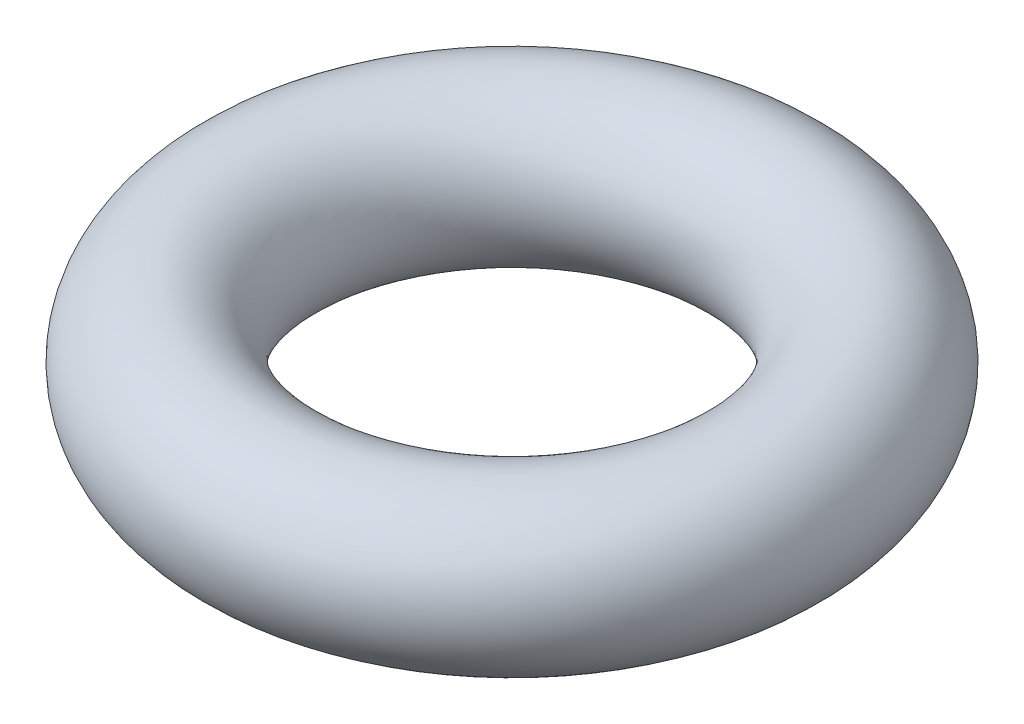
ISO-10303-21;
HEADER;
FILE_DESCRIPTION(('STEP AP214'),'2;1');
FILE_NAME('part.step','',(''),(''),'','','');
FILE_SCHEMA(('AUTOMOTIVE_DESIGN { 1 0 10303 214 1 1 1 1 }'));
ENDSEC;
DATA;
#1=APPLICATION_CONTEXT('core data for automotive mechanical design processes');
#2=APPLICATION_PROTOCOL_DEFINITION('international standard','automotive_design',2000,#1);
#3=PRODUCT_CONTEXT('',#1,'mechanical');
#4=PRODUCT('Part','Part','',(#3));
#5=PRODUCT_RELATED_PRODUCT_CATEGORY('part','',(#4));
#6=PRODUCT_DEFINITION_FORMATION('','',#4);
#7=PRODUCT_DEFINITION_CONTEXT('part definition',#1,'design');
#8=PRODUCT_DEFINITION('design','',#6,#7);
#9=PRODUCT_DEFINITION_SHAPE('','',#8);
#10=(LENGTH_UNIT() NAMED_UNIT(*) SI_UNIT(.MILLI.,.METRE.));
#11=(NAMED_UNIT(*) PLANE_ANGLE_UNIT() SI_UNIT($,.RADIAN.));
#12=(NAMED_UNIT(*) SI_UNIT($,.STERADIAN.) SOLID_ANGLE_UNIT());
#13=UNCERTAINTY_MEASURE_WITH_UNIT(LENGTH_MEASURE(1.E-05),#10,'distance_accuracy_value','');
#14=(GEOMETRIC_REPRESENTATION_CONTEXT(3) GLOBAL_UNCERTAINTY_ASSIGNED_CONTEXT((#13)) GLOBAL_UNIT_ASSIGNED_CONTEXT((#10,
#11,#12)) REPRESENTATION_CONTEXT('',''));
#15=CARTESIAN_POINT('',(0.,0.,0.));
#16=DIRECTION('',(0.,0.,1.));
#17=DIRECTION('',(1.,0.,0.));
#18=AXIS2_PLACEMENT_3D('',#15,#16,#17);
#19=CARTESIAN_POINT('',(0.,0.95,0.));
#20=DIRECTION('',(0.,-1.,0.));
#21=DIRECTION('',(0.,0.,-1.));
#22=AXIS2_PLACEMENT_3D('',#19,#20,#21);
#23=TOROIDAL_SURFACE('',#22,3.05,0.95);
#24=CARTESIAN_POINT('',(0.,0.95,-4.));
#25=VERTEX_POINT('',#24);
#26=VERTEX_LOOP('',#25);
#27=FACE_BOUND('',#26,.T.);
#28=ADVANCED_FACE('F30',(#27),#23,.T.);
#29=CLOSED_SHELL('',(#28));
#30=MANIFOLD_SOLID_BREP('B2',#29);
#31=ADVANCED_BREP_SHAPE_REPRESENTATION('',(#18,#30),#14);
#32=SHAPE_DEFINITION_REPRESENTATION(#9,#31);
ENDSEC;
END-ISO-10303-21;
